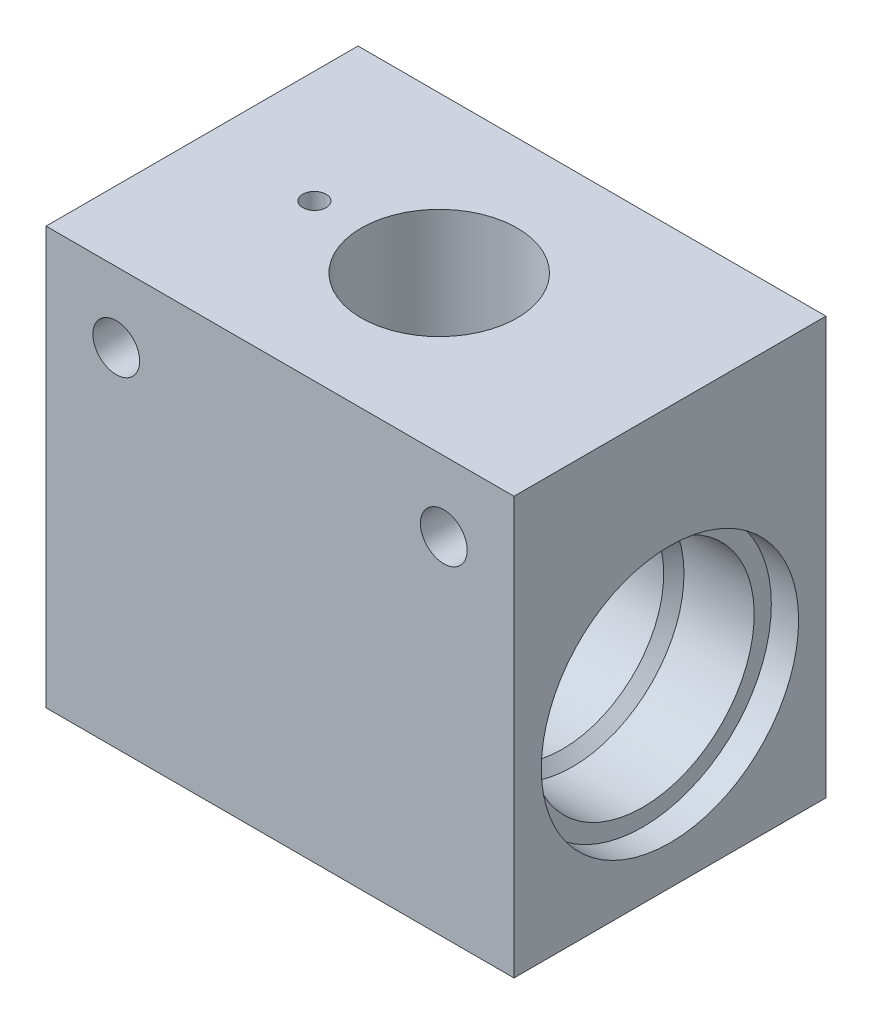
ISO-10303-21;
HEADER;
FILE_DESCRIPTION(('STEP AP214'),'2;1');
FILE_NAME('part.step','',(''),(''),'','','');
FILE_SCHEMA(('AUTOMOTIVE_DESIGN { 1 0 10303 214 1 1 1 1 }'));
ENDSEC;
DATA;
#1=APPLICATION_CONTEXT('core data for automotive mechanical design processes');
#2=APPLICATION_PROTOCOL_DEFINITION('international standard','automotive_design',2000,#1);
#3=PRODUCT_CONTEXT('',#1,'mechanical');
#4=PRODUCT('Part','Part','',(#3));
#5=PRODUCT_RELATED_PRODUCT_CATEGORY('part','',(#4));
#6=PRODUCT_DEFINITION_FORMATION('','',#4);
#7=PRODUCT_DEFINITION_CONTEXT('part definition',#1,'design');
#8=PRODUCT_DEFINITION('design','',#6,#7);
#9=PRODUCT_DEFINITION_SHAPE('','',#8);
#10=(LENGTH_UNIT() NAMED_UNIT(*) SI_UNIT(.MILLI.,.METRE.));
#11=(NAMED_UNIT(*) PLANE_ANGLE_UNIT() SI_UNIT($,.RADIAN.));
#12=(NAMED_UNIT(*) SI_UNIT($,.STERADIAN.) SOLID_ANGLE_UNIT());
#13=UNCERTAINTY_MEASURE_WITH_UNIT(LENGTH_MEASURE(1.E-05),#10,'distance_accuracy_value','');
#14=(GEOMETRIC_REPRESENTATION_CONTEXT(3) GLOBAL_UNCERTAINTY_ASSIGNED_CONTEXT((#13)) GLOBAL_UNIT_ASSIGNED_CONTEXT((#10,
#11,#12)) REPRESENTATION_CONTEXT('',''));
#15=CARTESIAN_POINT('',(0.,0.,0.));
#16=DIRECTION('',(0.,0.,1.));
#17=DIRECTION('',(1.,0.,0.));
#18=AXIS2_PLACEMENT_3D('',#15,#16,#17);
#19=CARTESIAN_POINT('',(0.,21.5,0.));
#20=DIRECTION('',(1.,0.,0.));
#21=DIRECTION('',(0.,1.,0.));
#22=AXIS2_PLACEMENT_3D('',#19,#20,#21);
#23=CYLINDRICAL_SURFACE('',#22,13.);
#24=CARTESIAN_POINT('',(46.2,21.5,0.));
#25=DIRECTION('',(-1.,0.,0.));
#26=DIRECTION('',(0.,-1.,0.));
#27=AXIS2_PLACEMENT_3D('',#24,#25,#26);
#28=CIRCLE('',#27,13.);
#29=CARTESIAN_POINT('',(46.1999999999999,8.49999999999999,0.));
#30=VERTEX_POINT('',#29);
#31=EDGE_CURVE('E239',#30,#30,#28,.T.);
#32=ORIENTED_EDGE('',*,*,#31,.F.);
#33=EDGE_LOOP('',(#32));
#34=FACE_BOUND('',#33,.T.);
#35=DIRECTION('',(1.,0.,0.));
#36=VECTOR('',#35,1.);
#37=CARTESIAN_POINT('',(0.,21.5,13.));
#38=LINE('',#37,#36);
#39=CARTESIAN_POINT('',(35.6096914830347,21.5,13.));
#40=VERTEX_POINT('',#39);
#41=CARTESIAN_POINT('',(25.2173866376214,21.5,13.));
#42=VERTEX_POINT('',#41);
#43=EDGE_CURVE('E11',#40,#42,#38,.F.);
#44=ORIENTED_EDGE('',*,*,#43,.F.);
#45=CARTESIAN_POINT('',(35.6096914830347,21.5,13.));
#46=CARTESIAN_POINT('',(35.6096803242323,21.5895443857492,13.0000020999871));
#47=CARTESIAN_POINT('',(35.6120076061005,21.6790693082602,12.9990744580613));
#48=CARTESIAN_POINT('',(35.6212345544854,21.8578198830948,12.9953816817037));
#49=CARTESIAN_POINT('',(35.6281328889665,21.9470456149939,12.992617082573));
#50=CARTESIAN_POINT('',(35.6554636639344,22.2133167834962,12.9816266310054));
#51=CARTESIAN_POINT('',(35.6825334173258,22.3896087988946,12.970703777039));
#52=CARTESIAN_POINT('',(35.7517661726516,22.7348101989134,12.9423596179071));
#53=CARTESIAN_POINT('',(35.7936110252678,22.903796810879,12.9250749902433));
#54=CARTESIAN_POINT('',(35.8901382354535,23.237430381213,12.8844715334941));
#55=CARTESIAN_POINT('',(35.9448325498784,23.4020731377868,12.861147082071));
#56=CARTESIAN_POINT('',(36.0973780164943,23.8152791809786,12.7946911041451));
#57=CARTESIAN_POINT('',(36.2024793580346,24.0605330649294,12.7477011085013));
#58=CARTESIAN_POINT('',(36.4300006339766,24.5401377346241,12.641912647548));
#59=CARTESIAN_POINT('',(36.5524309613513,24.7744818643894,12.5831070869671));
#60=CARTESIAN_POINT('',(36.8105912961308,25.2362170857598,12.4538677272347));
#61=CARTESIAN_POINT('',(36.9464630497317,25.4634912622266,12.3833030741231));
#62=CARTESIAN_POINT('',(37.2262592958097,25.9094544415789,12.2316066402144));
#63=CARTESIAN_POINT('',(37.3701868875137,26.1281400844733,12.1504707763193));
#64=CARTESIAN_POINT('',(37.6554212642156,26.5464827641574,11.9825320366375));
#65=CARTESIAN_POINT('',(37.796462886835,26.7465341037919,11.8962571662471));
#66=CARTESIAN_POINT('',(38.0813852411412,27.1404157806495,11.7146369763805));
#67=CARTESIAN_POINT('',(38.2252663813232,27.3342452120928,11.6192903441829));
#68=CARTESIAN_POINT('',(38.6591761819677,27.9072818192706,11.3195798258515));
#69=CARTESIAN_POINT('',(38.9513517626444,28.2778666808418,11.1016142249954));
#70=CARTESIAN_POINT('',(39.531798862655,28.9957768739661,10.6300010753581));
#71=CARTESIAN_POINT('',(39.8200810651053,29.3431860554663,10.3764937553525));
#72=CARTESIAN_POINT('',(40.3875059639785,30.0154240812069,9.8323131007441));
#73=CARTESIAN_POINT('',(40.6666537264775,30.340265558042,9.5416608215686));
#74=CARTESIAN_POINT('',(41.1397482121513,30.8842700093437,9.00232153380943));
#75=CARTESIAN_POINT('',(41.3370620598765,31.1090399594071,8.76221598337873));
#76=CARTESIAN_POINT('',(41.7210931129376,31.5434608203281,8.26068662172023));
#77=CARTESIAN_POINT('',(41.9078103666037,31.7531118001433,7.99926290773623));
#78=CARTESIAN_POINT('',(42.2678748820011,32.1551988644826,7.45526863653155));
#79=CARTESIAN_POINT('',(42.4412342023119,32.3476505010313,7.17271761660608));
#80=CARTESIAN_POINT('',(42.7719679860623,32.7132435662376,6.58653210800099));
#81=CARTESIAN_POINT('',(42.9293460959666,32.8863894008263,6.28290245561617));
#82=CARTESIAN_POINT('',(43.1947872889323,33.17746100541,5.71976596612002));
#83=CARTESIAN_POINT('',(43.3063434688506,33.2994276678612,5.46398807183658));
#84=CARTESIAN_POINT('',(43.5159183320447,33.5280685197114,4.94035839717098));
#85=CARTESIAN_POINT('',(43.6139400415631,33.6347461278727,4.67250933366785));
#86=CARTESIAN_POINT('',(43.7948711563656,33.8313228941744,4.12586930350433));
#87=CARTESIAN_POINT('',(43.8777863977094,33.9212285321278,3.84708261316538));
#88=CARTESIAN_POINT('',(44.0270616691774,34.0828836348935,3.2799346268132));
#89=CARTESIAN_POINT('',(44.0934215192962,34.1546329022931,2.99157322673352));
#90=CARTESIAN_POINT('',(44.2086641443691,34.2791249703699,2.40508914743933));
#91=CARTESIAN_POINT('',(44.2574189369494,34.3317286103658,2.10691153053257));
#92=CARTESIAN_POINT('',(44.3357044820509,34.41615036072,1.50511400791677));
#93=CARTESIAN_POINT('',(44.3652351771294,34.4479684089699,1.20149408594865));
#94=CARTESIAN_POINT('',(44.4043698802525,34.4901273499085,0.591600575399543));
#95=CARTESIAN_POINT('',(44.4139816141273,34.5004765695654,0.285328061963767));
#96=CARTESIAN_POINT('',(44.4130652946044,34.4994898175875,-0.327135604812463));
#97=CARTESIAN_POINT('',(44.4025390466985,34.4881557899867,-0.633326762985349));
#98=CARTESIAN_POINT('',(44.363915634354,34.4465461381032,-1.20852130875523));
#99=CARTESIAN_POINT('',(44.3379261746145,34.4185424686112,-1.47783665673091));
#100=CARTESIAN_POINT('',(44.270780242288,34.3461401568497,-2.01231079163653));
#101=CARTESIAN_POINT('',(44.2296251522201,34.301743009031,-2.27746995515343));
#102=CARTESIAN_POINT('',(44.1328680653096,34.1972586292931,-2.80199019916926));
#103=CARTESIAN_POINT('',(44.0772653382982,34.1371706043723,-3.06135098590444));
#104=CARTESIAN_POINT('',(43.9525206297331,34.0021872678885,-3.57285475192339));
#105=CARTESIAN_POINT('',(43.8833778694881,33.9272911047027,-3.82499731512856));
#106=CARTESIAN_POINT('',(43.7297921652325,33.7606557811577,-4.33008529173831));
#107=CARTESIAN_POINT('',(43.6448774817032,33.6683956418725,-4.5827147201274));
#108=CARTESIAN_POINT('',(43.4627898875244,33.4701497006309,-5.07806313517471));
#109=CARTESIAN_POINT('',(43.3656122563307,33.3641586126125,-5.32077825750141));
#110=CARTESIAN_POINT('',(43.1602526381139,33.1396206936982,-5.79553220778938));
#111=CARTESIAN_POINT('',(43.0520691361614,33.0210721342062,-6.02756955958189));
#112=CARTESIAN_POINT('',(42.825920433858,32.7725270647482,-6.48050125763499));
#113=CARTESIAN_POINT('',(42.7079531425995,32.6425281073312,-6.70139320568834));
#114=CARTESIAN_POINT('',(42.3992962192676,32.3012101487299,-7.2445770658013));
#115=CARTESIAN_POINT('',(42.2029004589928,32.082984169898,-7.55932693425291));
#116=CARTESIAN_POINT('',(41.7940002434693,31.6254845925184,-8.16197459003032));
#117=CARTESIAN_POINT('',(41.5814886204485,31.3862016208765,-8.44986030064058));
#118=CARTESIAN_POINT('',(41.1435798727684,30.8887038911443,-8.99943819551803));
#119=CARTESIAN_POINT('',(40.9181586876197,30.6304535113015,-9.26107879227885));
#120=CARTESIAN_POINT('',(40.4582703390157,30.0973727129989,-9.75796895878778));
#121=CARTESIAN_POINT('',(40.2238046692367,29.8225450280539,-9.9932228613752));
#122=CARTESIAN_POINT('',(39.7434928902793,29.2506630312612,-10.4433144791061));
#123=CARTESIAN_POINT('',(39.4975087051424,28.9532337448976,-10.6575272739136));
#124=CARTESIAN_POINT('',(39.0035044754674,28.3424992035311,-11.0595632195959));
#125=CARTESIAN_POINT('',(38.7554838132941,28.0291889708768,-11.2473780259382));
#126=CARTESIAN_POINT('',(38.2621957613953,27.385945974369,-11.5969741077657));
#127=CARTESIAN_POINT('',(38.0169295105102,27.0560066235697,-11.7587449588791));
#128=CARTESIAN_POINT('',(37.6565581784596,26.5473219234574,-11.9815985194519));
#129=CARTESIAN_POINT('',(37.5377127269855,26.3755011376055,-12.0525700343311));
#130=CARTESIAN_POINT('',(37.30374828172,26.0267819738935,-12.1878316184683));
#131=CARTESIAN_POINT('',(37.1886286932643,25.8498844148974,-12.2521227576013));
#132=CARTESIAN_POINT('',(36.9698771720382,25.500386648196,-12.3704904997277));
#133=CARTESIAN_POINT('',(36.8659619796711,25.3280892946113,-12.4249352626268));
#134=CARTESIAN_POINT('',(36.6645892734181,24.9779513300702,-12.5274548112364));
#135=CARTESIAN_POINT('',(36.5671298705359,24.800112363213,-12.5755314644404));
#136=CARTESIAN_POINT('',(36.3815800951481,24.4395959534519,-12.6646357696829));
#137=CARTESIAN_POINT('',(36.2934258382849,24.2569639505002,-12.7057128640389));
#138=CARTESIAN_POINT('',(36.1285242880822,23.8851228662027,-12.7807334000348));
#139=CARTESIAN_POINT('',(36.0517762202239,23.6959142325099,-12.8146773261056));
#140=CARTESIAN_POINT('',(35.9256684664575,23.3453389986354,-12.8693546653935));
#141=CARTESIAN_POINT('',(35.8738653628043,23.1850581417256,-12.8913653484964));
#142=CARTESIAN_POINT('',(35.7825734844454,22.8604391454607,-12.9296521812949));
#143=CARTESIAN_POINT('',(35.7430749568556,22.6961043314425,-12.9459328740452));
#144=CARTESIAN_POINT('',(35.6779651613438,22.3610861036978,-12.9725542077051));
#145=CARTESIAN_POINT('',(35.652615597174,22.1903416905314,-12.9827831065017));
#146=CARTESIAN_POINT('',(35.6183569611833,21.8464487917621,-12.9965368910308));
#147=CARTESIAN_POINT('',(35.6094974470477,21.6732946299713,-13.0000415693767));
#148=CARTESIAN_POINT('',(35.6096914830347,21.5,-13.));
#149=B_SPLINE_CURVE_WITH_KNOTS('',3,(#45,#46,#47,#48,#49,#50,#51,#52,#53,#54,#55,#56,#57,#58,
#59,#60,#61,#62,#63,#64,#65,#66,#67,#68,#69,#70,#71,#72,#73,#74,#75,#76,#77,#78,#79,#80,#81,#82,
#83,#84,#85,#86,#87,#88,#89,#90,#91,#92,#93,#94,#95,#96,#97,#98,#99,#100,#101,#102,#103,#104,
#105,#106,#107,#108,#109,#110,#111,#112,#113,#114,#115,#116,#117,#118,#119,#120,#121,#122,#123,
#124,#125,#126,#127,#128,#129,#130,#131,#132,#133,#134,#135,#136,#137,#138,#139,#140,#141,#142,
#143,#144,#145,#146,#147,#148),.UNSPECIFIED.,.F.,.F.,(4,2,2,2,2,2,2,2,2,2,2,2,2,2,2,2,2,2,2,2,2,
2,2,2,2,2,2,2,2,2,2,2,2,2,2,2,2,2,2,2,2,2,2,2,2,2,2,2,2,2,2,4),(0.,0.268561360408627,
0.537044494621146,1.0720636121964,1.59620197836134,2.12083001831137,2.93216398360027,
3.74398662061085,4.56553389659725,5.38739943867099,6.16572090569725,6.94415517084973,
8.50167979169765,10.0532236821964,11.6038919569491,12.7536059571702,13.9033147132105,
15.0519731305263,16.2003688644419,17.1131423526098,18.0257114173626,18.9379271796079,
19.850152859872,20.7688825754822,21.6876150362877,22.6059910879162,23.5242848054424,
24.3393739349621,25.1543887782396,25.9694448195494,26.7845477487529,27.6298326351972,
28.475443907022,29.3211717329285,30.1670807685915,31.4564021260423,32.7463003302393,
34.0386862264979,35.3308595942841,36.6540217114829,37.9776011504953,39.3017090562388,
39.9634910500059,40.6251668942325,41.2502724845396,41.8751943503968,42.4955004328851,
43.1157643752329,43.6248918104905,44.1336146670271,44.6514591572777,45.1708574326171),.UNSPECIFIED.);
#150=CARTESIAN_POINT('',(35.6096914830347,21.5,-13.));
#151=VERTEX_POINT('',#150);
#152=EDGE_CURVE('E42',#40,#151,#149,.T.);
#153=ORIENTED_EDGE('',*,*,#152,.T.);
#154=DIRECTION('',(1.,0.,0.));
#155=VECTOR('',#154,1.);
#156=CARTESIAN_POINT('',(0.,21.5,-13.));
#157=LINE('',#156,#155);
#158=CARTESIAN_POINT('',(25.2173866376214,21.5,-13.));
#159=VERTEX_POINT('',#158);
#160=EDGE_CURVE('E216',#159,#151,#157,.T.);
#161=ORIENTED_EDGE('',*,*,#160,.F.);
#162=CARTESIAN_POINT('',(25.2173866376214,21.5,-13.));
#163=CARTESIAN_POINT('',(25.2173977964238,21.5895443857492,-13.0000020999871));
#164=CARTESIAN_POINT('',(25.2150705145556,21.6790693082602,-12.9990744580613));
#165=CARTESIAN_POINT('',(25.2058435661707,21.8578198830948,-12.9953816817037));
#166=CARTESIAN_POINT('',(25.1989452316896,21.9470456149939,-12.992617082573));
#167=CARTESIAN_POINT('',(25.1716144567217,22.2133167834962,-12.9816266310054));
#168=CARTESIAN_POINT('',(25.1445447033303,22.3896087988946,-12.970703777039));
#169=CARTESIAN_POINT('',(25.0753119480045,22.7348101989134,-12.9423596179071));
#170=CARTESIAN_POINT('',(25.0334670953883,22.903796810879,-12.9250749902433));
#171=CARTESIAN_POINT('',(24.9369398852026,23.237430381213,-12.8844715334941));
#172=CARTESIAN_POINT('',(24.8822455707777,23.4020731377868,-12.861147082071));
#173=CARTESIAN_POINT('',(24.7297001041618,23.8152791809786,-12.7946911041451));
#174=CARTESIAN_POINT('',(24.6245987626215,24.0605330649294,-12.7477011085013));
#175=CARTESIAN_POINT('',(24.3970774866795,24.5401377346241,-12.641912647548));
#176=CARTESIAN_POINT('',(24.2746471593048,24.7744818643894,-12.5831070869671));
#177=CARTESIAN_POINT('',(24.0164868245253,25.2362170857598,-12.4538677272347));
#178=CARTESIAN_POINT('',(23.8806150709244,25.4634912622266,-12.3833030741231));
#179=CARTESIAN_POINT('',(23.6008188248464,25.9094544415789,-12.2316066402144));
#180=CARTESIAN_POINT('',(23.4568912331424,26.1281400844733,-12.1504707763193));
#181=CARTESIAN_POINT('',(23.1716568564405,26.5464827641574,-11.9825320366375));
#182=CARTESIAN_POINT('',(23.0306152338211,26.7465341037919,-11.8962571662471));
#183=CARTESIAN_POINT('',(22.7456928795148,27.1404157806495,-11.7146369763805));
#184=CARTESIAN_POINT('',(22.6018117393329,27.3342452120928,-11.6192903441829));
#185=CARTESIAN_POINT('',(22.1679019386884,27.9072818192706,-11.3195798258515));
#186=CARTESIAN_POINT('',(21.8757263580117,28.2778666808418,-11.1016142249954));
#187=CARTESIAN_POINT('',(21.2952792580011,28.9957768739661,-10.6300010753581));
#188=CARTESIAN_POINT('',(21.0069970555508,29.3431860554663,-10.3764937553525));
#189=CARTESIAN_POINT('',(20.4395721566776,30.0154240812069,-9.83231310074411));
#190=CARTESIAN_POINT('',(20.1604243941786,30.340265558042,-9.54166082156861));
#191=CARTESIAN_POINT('',(19.6873299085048,30.8842700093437,-9.00232153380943));
#192=CARTESIAN_POINT('',(19.4900160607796,31.1090399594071,-8.76221598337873));
#193=CARTESIAN_POINT('',(19.1059850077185,31.5434608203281,-8.26068662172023));
#194=CARTESIAN_POINT('',(18.9192677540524,31.7531118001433,-7.99926290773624));
#195=CARTESIAN_POINT('',(18.559203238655,32.1551988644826,-7.45526863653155));
#196=CARTESIAN_POINT('',(18.3858439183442,32.3476505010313,-7.17271761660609));
#197=CARTESIAN_POINT('',(18.0551101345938,32.7132435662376,-6.586532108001));
#198=CARTESIAN_POINT('',(17.8977320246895,32.8863894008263,-6.28290245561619));
#199=CARTESIAN_POINT('',(17.6322908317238,33.1774610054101,-5.71976596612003));
#200=CARTESIAN_POINT('',(17.5207346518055,33.2994276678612,-5.46398807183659));
#201=CARTESIAN_POINT('',(17.3111597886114,33.5280685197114,-4.94035839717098));
#202=CARTESIAN_POINT('',(17.213138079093,33.6347461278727,-4.67250933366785));
#203=CARTESIAN_POINT('',(17.0322069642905,33.8313228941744,-4.12586930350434));
#204=CARTESIAN_POINT('',(16.9492917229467,33.9212285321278,-3.84708261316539));
#205=CARTESIAN_POINT('',(16.8000164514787,34.0828836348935,-3.2799346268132));
#206=CARTESIAN_POINT('',(16.7336566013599,34.1546329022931,-2.99157322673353));
#207=CARTESIAN_POINT('',(16.618413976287,34.2791249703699,-2.40508914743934));
#208=CARTESIAN_POINT('',(16.5696591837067,34.3317286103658,-2.10691153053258));
#209=CARTESIAN_POINT('',(16.4913736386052,34.41615036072,-1.50511400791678));
#210=CARTESIAN_POINT('',(16.4618429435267,34.4479684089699,-1.20149408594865));
#211=CARTESIAN_POINT('',(16.4227082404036,34.4901273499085,-0.591600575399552));
#212=CARTESIAN_POINT('',(16.4130965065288,34.5004765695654,-0.285328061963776));
#213=CARTESIAN_POINT('',(16.4140128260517,34.4994898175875,0.327135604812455));
#214=CARTESIAN_POINT('',(16.4245390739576,34.4881557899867,0.633326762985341));
#215=CARTESIAN_POINT('',(16.4631624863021,34.4465461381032,1.20852130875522));
#216=CARTESIAN_POINT('',(16.4891519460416,34.4185424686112,1.4778366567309));
#217=CARTESIAN_POINT('',(16.5562978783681,34.3461401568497,2.01231079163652));
#218=CARTESIAN_POINT('',(16.597452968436,34.301743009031,2.27746995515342));
#219=CARTESIAN_POINT('',(16.6942100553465,34.1972586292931,2.80199019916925));
#220=CARTESIAN_POINT('',(16.7498127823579,34.1371706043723,3.06135098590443));
#221=CARTESIAN_POINT('',(16.874557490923,34.0021872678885,3.57285475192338));
#222=CARTESIAN_POINT('',(16.943700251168,33.9272911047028,3.82499731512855));
#223=CARTESIAN_POINT('',(17.0972859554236,33.7606557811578,4.33008529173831));
#224=CARTESIAN_POINT('',(17.1822006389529,33.6683956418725,4.58271472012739));
#225=CARTESIAN_POINT('',(17.3642882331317,33.470149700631,5.0780631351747));
#226=CARTESIAN_POINT('',(17.4614658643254,33.3641586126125,5.32077825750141));
#227=CARTESIAN_POINT('',(17.6668254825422,33.1396206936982,5.79553220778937));
#228=CARTESIAN_POINT('',(17.7750089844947,33.0210721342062,6.02756955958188));
#229=CARTESIAN_POINT('',(18.0011576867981,32.7725270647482,6.48050125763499));
#230=CARTESIAN_POINT('',(18.1191249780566,32.6425281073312,6.70139320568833));
#231=CARTESIAN_POINT('',(18.4277819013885,32.3012101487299,7.2445770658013));
#232=CARTESIAN_POINT('',(18.6241776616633,32.082984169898,7.5593269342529));
#233=CARTESIAN_POINT('',(19.0330778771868,31.6254845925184,8.16197459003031));
#234=CARTESIAN_POINT('',(19.2455895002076,31.3862016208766,8.44986030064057));
#235=CARTESIAN_POINT('',(19.6834982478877,30.8887038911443,8.99943819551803));
#236=CARTESIAN_POINT('',(19.9089194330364,30.6304535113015,9.26107879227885));
#237=CARTESIAN_POINT('',(20.3688077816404,30.0973727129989,9.75796895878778));
#238=CARTESIAN_POINT('',(20.6032734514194,29.8225450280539,9.99322286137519));
#239=CARTESIAN_POINT('',(21.0835852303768,29.2506630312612,10.4433144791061));
#240=CARTESIAN_POINT('',(21.3295694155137,28.9532337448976,10.6575272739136));
#241=CARTESIAN_POINT('',(21.8235736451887,28.3424992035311,11.0595632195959));
#242=CARTESIAN_POINT('',(22.071594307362,28.0291889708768,11.2473780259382));
#243=CARTESIAN_POINT('',(22.5648823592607,27.385945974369,11.5969741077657));
#244=CARTESIAN_POINT('',(22.8101486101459,27.0560066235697,11.7587449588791));
#245=CARTESIAN_POINT('',(23.1705199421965,26.5473219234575,11.9815985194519));
#246=CARTESIAN_POINT('',(23.2893653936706,26.3755011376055,12.0525700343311));
#247=CARTESIAN_POINT('',(23.523329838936,26.0267819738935,12.1878316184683));
#248=CARTESIAN_POINT('',(23.6384494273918,25.8498844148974,12.2521227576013));
#249=CARTESIAN_POINT('',(23.8572009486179,25.500386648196,12.3704904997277));
#250=CARTESIAN_POINT('',(23.961116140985,25.3280892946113,12.4249352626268));
#251=CARTESIAN_POINT('',(24.1624888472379,24.9779513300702,12.5274548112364));
#252=CARTESIAN_POINT('',(24.2599482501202,24.800112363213,12.5755314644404));
#253=CARTESIAN_POINT('',(24.445498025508,24.4395959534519,12.6646357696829));
#254=CARTESIAN_POINT('',(24.5336522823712,24.2569639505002,12.7057128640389));
#255=CARTESIAN_POINT('',(24.6985538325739,23.8851228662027,12.7807334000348));
#256=CARTESIAN_POINT('',(24.7753019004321,23.69591423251,12.8146773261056));
#257=CARTESIAN_POINT('',(24.9014096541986,23.3453389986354,12.8693546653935));
#258=CARTESIAN_POINT('',(24.9532127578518,23.1850581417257,12.8913653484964));
#259=CARTESIAN_POINT('',(25.0445046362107,22.8604391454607,12.9296521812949));
#260=CARTESIAN_POINT('',(25.0840031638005,22.6961043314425,12.9459328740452));
#261=CARTESIAN_POINT('',(25.1491129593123,22.3610861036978,12.9725542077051));
#262=CARTESIAN_POINT('',(25.1744625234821,22.1903416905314,12.9827831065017));
#263=CARTESIAN_POINT('',(25.2087211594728,21.8464487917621,12.9965368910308));
#264=CARTESIAN_POINT('',(25.2175806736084,21.6732946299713,13.0000415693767));
#265=CARTESIAN_POINT('',(25.2173866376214,21.5,13.));
#266=B_SPLINE_CURVE_WITH_KNOTS('',3,(#162,#163,#164,#165,#166,#167,#168,#169,#170,#171,#172,
#173,#174,#175,#176,#177,#178,#179,#180,#181,#182,#183,#184,#185,#186,#187,#188,#189,#190,#191,
#192,#193,#194,#195,#196,#197,#198,#199,#200,#201,#202,#203,#204,#205,#206,#207,#208,#209,#210,
#211,#212,#213,#214,#215,#216,#217,#218,#219,#220,#221,#222,#223,#224,#225,#226,#227,#228,#229,
#230,#231,#232,#233,#234,#235,#236,#237,#238,#239,#240,#241,#242,#243,#244,#245,#246,#247,#248,
#249,#250,#251,#252,#253,#254,#255,#256,#257,#258,#259,#260,#261,#262,#263,#264,#265),
.UNSPECIFIED.,.F.,.F.,(4,2,2,2,2,2,2,2,2,2,2,2,2,2,2,2,2,2,2,2,2,2,2,2,2,2,2,2,2,2,2,2,2,2,2,2,
2,2,2,2,2,2,2,2,2,2,2,2,2,2,2,4),(0.,0.268561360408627,0.537044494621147,1.0720636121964,
1.59620197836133,2.12083001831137,2.93216398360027,3.74398662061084,4.56553389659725,
5.38739943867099,6.16572090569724,6.94415517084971,8.50167979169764,10.0532236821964,
11.6038919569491,12.7536059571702,13.9033147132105,15.0519731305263,16.2003688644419,
17.1131423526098,18.0257114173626,18.9379271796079,19.850152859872,20.7688825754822,
21.6876150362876,22.6059910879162,23.5242848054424,24.3393739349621,25.1543887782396,
25.9694448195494,26.7845477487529,27.6298326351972,28.475443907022,29.3211717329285,
30.1670807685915,31.4564021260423,32.7463003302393,34.0386862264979,35.3308595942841,
36.6540217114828,37.9776011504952,39.3017090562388,39.9634910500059,40.6251668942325,
41.2502724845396,41.8751943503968,42.4955004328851,43.1157643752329,43.6248918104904,
44.1336146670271,44.6514591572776,45.1708574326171),.UNSPECIFIED.);
#267=EDGE_CURVE('E125',#159,#42,#266,.T.);
#268=ORIENTED_EDGE('',*,*,#267,.T.);
#269=EDGE_LOOP('',(#44,#153,#161,#268));
#270=FACE_BOUND('',#269,.T.);
#271=CARTESIAN_POINT('',(13.8,21.5,0.));
#272=DIRECTION('',(-1.,0.,0.));
#273=DIRECTION('',(0.,-1.,0.));
#274=AXIS2_PLACEMENT_3D('',#271,#272,#273);
#275=CIRCLE('',#274,13.);
#276=CARTESIAN_POINT('',(13.8,8.50000000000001,0.));
#277=VERTEX_POINT('',#276);
#278=EDGE_CURVE('E229',#277,#277,#275,.T.);
#279=ORIENTED_EDGE('',*,*,#278,.T.);
#280=EDGE_LOOP('',(#279));
#281=FACE_BOUND('',#280,.T.);
#282=ADVANCED_FACE('F34',(#34,#270,#281),#23,.F.);
#283=CARTESIAN_POINT('',(3.5,21.5,0.));
#284=DIRECTION('',(-1.,0.,0.));
#285=DIRECTION('',(0.,0.,1.));
#286=AXIS2_PLACEMENT_3D('',#283,#284,#285);
#287=PLANE('',#286);
#288=CARTESIAN_POINT('',(3.5,21.5,0.));
#289=DIRECTION('',(-1.,0.,0.));
#290=DIRECTION('',(0.,0.,1.));
#291=AXIS2_PLACEMENT_3D('',#288,#289,#290);
#292=CIRCLE('',#291,16.5);
#293=CARTESIAN_POINT('',(3.5,21.5,16.5));
#294=VERTEX_POINT('',#293);
#295=EDGE_CURVE('E188',#294,#294,#292,.T.);
#296=ORIENTED_EDGE('',*,*,#295,.T.);
#297=EDGE_LOOP('',(#296));
#298=FACE_BOUND('',#297,.T.);
#299=CARTESIAN_POINT('',(3.49999999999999,21.5,0.));
#300=DIRECTION('',(-1.,0.,0.));
#301=DIRECTION('',(0.,-1.,0.));
#302=AXIS2_PLACEMENT_3D('',#299,#300,#301);
#303=CIRCLE('',#302,14.3);
#304=CARTESIAN_POINT('',(3.49999999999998,7.20000000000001,0.));
#305=VERTEX_POINT('',#304);
#306=EDGE_CURVE('E234',#305,#305,#303,.T.);
#307=ORIENTED_EDGE('',*,*,#306,.F.);
#308=EDGE_LOOP('',(#307));
#309=FACE_BOUND('',#308,.T.);
#310=ADVANCED_FACE('F106',(#298,#309),#287,.T.);
#311=CARTESIAN_POINT('',(56.5,21.5,0.));
#312=DIRECTION('',(1.,0.,0.));
#313=DIRECTION('',(0.,1.,0.));
#314=AXIS2_PLACEMENT_3D('',#311,#312,#313);
#315=PLANE('',#314);
#316=CARTESIAN_POINT('',(56.5,21.5,0.));
#317=DIRECTION('',(1.,0.,0.));
#318=DIRECTION('',(0.,1.,0.));
#319=AXIS2_PLACEMENT_3D('',#316,#317,#318);
#320=CIRCLE('',#319,16.5);
#321=CARTESIAN_POINT('',(56.5,38.,0.));
#322=VERTEX_POINT('',#321);
#323=EDGE_CURVE('E182',#322,#322,#320,.T.);
#324=ORIENTED_EDGE('',*,*,#323,.T.);
#325=EDGE_LOOP('',(#324));
#326=FACE_BOUND('',#325,.T.);
#327=CARTESIAN_POINT('',(56.5,21.5,0.));
#328=DIRECTION('',(-1.,0.,0.));
#329=DIRECTION('',(0.,-1.,0.));
#330=AXIS2_PLACEMENT_3D('',#327,#328,#329);
#331=CIRCLE('',#330,14.3);
#332=CARTESIAN_POINT('',(56.5,7.19999999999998,0.));
#333=VERTEX_POINT('',#332);
#334=EDGE_CURVE('E245',#333,#333,#331,.T.);
#335=ORIENTED_EDGE('',*,*,#334,.T.);
#336=EDGE_LOOP('',(#335));
#337=FACE_BOUND('',#336,.T.);
#338=ADVANCED_FACE('F112',(#326,#337),#315,.T.);
#339=CARTESIAN_POINT('',(60.,53.5,20.));
#340=DIRECTION('',(0.,-1.,0.));
#341=DIRECTION('',(1.,0.,0.));
#342=AXIS2_PLACEMENT_3D('',#339,#340,#341);
#343=PLANE('',#342);
#344=DIRECTION('',(0.,0.,-1.));
#345=VECTOR('',#344,1.);
#346=CARTESIAN_POINT('',(60.,53.5,20.));
#347=LINE('',#346,#345);
#348=CARTESIAN_POINT('',(60.,53.5,20.));
#349=VERTEX_POINT('',#348);
#350=CARTESIAN_POINT('',(60.,53.5,-20.));
#351=VERTEX_POINT('',#350);
#352=EDGE_CURVE('E219',#349,#351,#347,.T.);
#353=ORIENTED_EDGE('',*,*,#352,.T.);
#354=DIRECTION('',(-1.,0.,0.));
#355=VECTOR('',#354,1.);
#356=CARTESIAN_POINT('',(60.,53.5,-20.));
#357=LINE('',#356,#355);
#358=CARTESIAN_POINT('',(0.,53.5,-20.));
#359=VERTEX_POINT('',#358);
#360=EDGE_CURVE('E196',#351,#359,#357,.T.);
#361=ORIENTED_EDGE('',*,*,#360,.T.);
#362=DIRECTION('',(0.,0.,-1.));
#363=VECTOR('',#362,1.);
#364=CARTESIAN_POINT('',(0.,53.5,20.));
#365=LINE('',#364,#363);
#366=CARTESIAN_POINT('',(0.,53.5,20.));
#367=VERTEX_POINT('',#366);
#368=EDGE_CURVE('E214',#367,#359,#365,.T.);
#369=ORIENTED_EDGE('',*,*,#368,.F.);
#370=DIRECTION('',(-1.,0.,0.));
#371=VECTOR('',#370,1.);
#372=CARTESIAN_POINT('',(60.,53.5,20.));
#373=LINE('',#372,#371);
#374=EDGE_CURVE('E207',#349,#367,#373,.T.);
#375=ORIENTED_EDGE('',*,*,#374,.F.);
#376=EDGE_LOOP('',(#353,#361,#369,#375));
#377=FACE_BOUND('',#376,.T.);
#378=CARTESIAN_POINT('',(30.4135390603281,53.5,0.));
#379=DIRECTION('',(0.,1.,0.));
#380=DIRECTION('',(-1.,0.,0.));
#381=AXIS2_PLACEMENT_3D('',#378,#379,#380);
#382=CIRCLE('',#381,10.);
#383=CARTESIAN_POINT('',(20.4135390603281,53.5,0.));
#384=VERTEX_POINT('',#383);
#385=EDGE_CURVE('E178',#384,#384,#382,.T.);
#386=ORIENTED_EDGE('',*,*,#385,.F.);
#387=EDGE_LOOP('',(#386));
#388=FACE_BOUND('',#387,.T.);
#389=CARTESIAN_POINT('',(14.4135390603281,53.5,0.));
#390=DIRECTION('',(0.,1.,0.));
#391=DIRECTION('',(0.,0.,1.));
#392=AXIS2_PLACEMENT_3D('',#389,#390,#391);
#393=CIRCLE('',#392,1.5);
#394=CARTESIAN_POINT('',(14.4135390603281,53.5,1.5));
#395=VERTEX_POINT('',#394);
#396=EDGE_CURVE('E248',#395,#395,#393,.T.);
#397=ORIENTED_EDGE('',*,*,#396,.F.);
#398=EDGE_LOOP('',(#397));
#399=FACE_BOUND('',#398,.T.);
#400=ADVANCED_FACE('F271',(#377,#388,#399),#343,.F.);
#401=CARTESIAN_POINT('',(0.,0.,20.));
#402=DIRECTION('',(-1.,0.,0.));
#403=DIRECTION('',(0.,0.,1.));
#404=AXIS2_PLACEMENT_3D('',#401,#402,#403);
#405=PLANE('',#404);
#406=CARTESIAN_POINT('',(0.,21.5,0.));
#407=DIRECTION('',(-1.,0.,0.));
#408=DIRECTION('',(0.,0.,1.));
#409=AXIS2_PLACEMENT_3D('',#406,#407,#408);
#410=CIRCLE('',#409,16.5);
#411=CARTESIAN_POINT('',(0.,21.5,16.5));
#412=VERTEX_POINT('',#411);
#413=EDGE_CURVE('E185',#412,#412,#410,.T.);
#414=ORIENTED_EDGE('',*,*,#413,.F.);
#415=EDGE_LOOP('',(#414));
#416=FACE_BOUND('',#415,.T.);
#417=ORIENTED_EDGE('',*,*,#368,.T.);
#418=DIRECTION('',(0.,1.,0.));
#419=VECTOR('',#418,1.);
#420=CARTESIAN_POINT('',(0.,0.,-20.));
#421=LINE('',#420,#419);
#422=CARTESIAN_POINT('',(0.,0.,-20.));
#423=VERTEX_POINT('',#422);
#424=EDGE_CURVE('E191',#423,#359,#421,.T.);
#425=ORIENTED_EDGE('',*,*,#424,.F.);
#426=DIRECTION('',(0.,0.,-1.));
#427=VECTOR('',#426,1.);
#428=CARTESIAN_POINT('',(0.,0.,20.));
#429=LINE('',#428,#427);
#430=CARTESIAN_POINT('',(0.,0.,20.));
#431=VERTEX_POINT('',#430);
#432=EDGE_CURVE('E56',#431,#423,#429,.T.);
#433=ORIENTED_EDGE('',*,*,#432,.F.);
#434=DIRECTION('',(0.,1.,0.));
#435=VECTOR('',#434,1.);
#436=CARTESIAN_POINT('',(0.,0.,20.));
#437=LINE('',#436,#435);
#438=EDGE_CURVE('E205',#431,#367,#437,.T.);
#439=ORIENTED_EDGE('',*,*,#438,.T.);
#440=EDGE_LOOP('',(#417,#425,#433,#439));
#441=FACE_BOUND('',#440,.T.);
#442=ADVANCED_FACE('F36',(#416,#441),#405,.T.);
#443=CARTESIAN_POINT('',(0.,0.,20.));
#444=DIRECTION('',(0.,1.,0.));
#445=DIRECTION('',(0.,0.,1.));
#446=AXIS2_PLACEMENT_3D('',#443,#444,#445);
#447=PLANE('',#446);
#448=ORIENTED_EDGE('',*,*,#432,.T.);
#449=DIRECTION('',(1.,0.,0.));
#450=VECTOR('',#449,1.);
#451=CARTESIAN_POINT('',(0.,0.,-20.));
#452=LINE('',#451,#450);
#453=CARTESIAN_POINT('',(60.,0.,-20.));
#454=VERTEX_POINT('',#453);
#455=EDGE_CURVE('E202',#423,#454,#452,.T.);
#456=ORIENTED_EDGE('',*,*,#455,.T.);
#457=DIRECTION('',(0.,0.,-1.));
#458=VECTOR('',#457,1.);
#459=CARTESIAN_POINT('',(60.,0.,20.));
#460=LINE('',#459,#458);
#461=CARTESIAN_POINT('',(60.,0.,20.));
#462=VERTEX_POINT('',#461);
#463=EDGE_CURVE('E217',#462,#454,#460,.T.);
#464=ORIENTED_EDGE('',*,*,#463,.F.);
#465=DIRECTION('',(1.,0.,0.));
#466=VECTOR('',#465,1.);
#467=CARTESIAN_POINT('',(0.,0.,20.));
#468=LINE('',#467,#466);
#469=EDGE_CURVE('E212',#431,#462,#468,.T.);
#470=ORIENTED_EDGE('',*,*,#469,.F.);
#471=EDGE_LOOP('',(#448,#456,#464,#470));
#472=FACE_BOUND('',#471,.T.);
#473=ADVANCED_FACE('F276',(#472),#447,.F.);
#474=CARTESIAN_POINT('',(60.,53.5,20.));
#475=DIRECTION('',(1.,0.,0.));
#476=DIRECTION('',(0.,1.,0.));
#477=AXIS2_PLACEMENT_3D('',#474,#475,#476);
#478=PLANE('',#477);
#479=CARTESIAN_POINT('',(60.,21.5,0.));
#480=DIRECTION('',(1.,0.,0.));
#481=DIRECTION('',(0.,1.,0.));
#482=AXIS2_PLACEMENT_3D('',#479,#480,#481);
#483=CIRCLE('',#482,16.5);
#484=CARTESIAN_POINT('',(60.,38.,0.));
#485=VERTEX_POINT('',#484);
#486=EDGE_CURVE('E181',#485,#485,#483,.T.);
#487=ORIENTED_EDGE('',*,*,#486,.F.);
#488=EDGE_LOOP('',(#487));
#489=FACE_BOUND('',#488,.T.);
#490=ORIENTED_EDGE('',*,*,#463,.T.);
#491=DIRECTION('',(0.,-1.,0.));
#492=VECTOR('',#491,1.);
#493=CARTESIAN_POINT('',(60.,53.5,-20.));
#494=LINE('',#493,#492);
#495=EDGE_CURVE('E199',#351,#454,#494,.T.);
#496=ORIENTED_EDGE('',*,*,#495,.F.);
#497=ORIENTED_EDGE('',*,*,#352,.F.);
#498=DIRECTION('',(0.,-1.,0.));
#499=VECTOR('',#498,1.);
#500=CARTESIAN_POINT('',(60.,53.5,20.));
#501=LINE('',#500,#499);
#502=EDGE_CURVE('E209',#349,#462,#501,.T.);
#503=ORIENTED_EDGE('',*,*,#502,.T.);
#504=EDGE_LOOP('',(#490,#496,#497,#503));
#505=FACE_BOUND('',#504,.T.);
#506=ADVANCED_FACE('F259',(#489,#505),#478,.T.);
#507=CARTESIAN_POINT('',(0.,0.,20.));
#508=DIRECTION('',(0.,0.,-1.));
#509=DIRECTION('',(-1.,0.,0.));
#510=AXIS2_PLACEMENT_3D('',#507,#508,#509);
#511=PLANE('',#510);
#512=CARTESIAN_POINT('',(51.,44.5015290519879,20.));
#513=DIRECTION('',(0.,0.,1.));
#514=DIRECTION('',(1.,0.,0.));
#515=AXIS2_PLACEMENT_3D('',#512,#513,#514);
#516=CIRCLE('',#515,3.);
#517=CARTESIAN_POINT('',(54.,44.5015290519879,20.));
#518=VERTEX_POINT('',#517);
#519=EDGE_CURVE('E166',#518,#518,#516,.T.);
#520=ORIENTED_EDGE('',*,*,#519,.F.);
#521=EDGE_LOOP('',(#520));
#522=FACE_BOUND('',#521,.T.);
#523=CARTESIAN_POINT('',(9.,44.5015290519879,20.));
#524=DIRECTION('',(0.,0.,1.));
#525=DIRECTION('',(1.,0.,0.));
#526=AXIS2_PLACEMENT_3D('',#523,#524,#525);
#527=CIRCLE('',#526,3.);
#528=CARTESIAN_POINT('',(12.,44.5015290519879,20.));
#529=VERTEX_POINT('',#528);
#530=EDGE_CURVE('E159',#529,#529,#527,.T.);
#531=ORIENTED_EDGE('',*,*,#530,.F.);
#532=EDGE_LOOP('',(#531));
#533=FACE_BOUND('',#532,.T.);
#534=ORIENTED_EDGE('',*,*,#438,.F.);
#535=ORIENTED_EDGE('',*,*,#469,.T.);
#536=ORIENTED_EDGE('',*,*,#502,.F.);
#537=ORIENTED_EDGE('',*,*,#374,.T.);
#538=EDGE_LOOP('',(#534,#535,#536,#537));
#539=FACE_BOUND('',#538,.T.);
#540=ADVANCED_FACE('F256',(#522,#533,#539),#511,.F.);
#541=CARTESIAN_POINT('',(0.,0.,-20.));
#542=DIRECTION('',(0.,0.,-1.));
#543=DIRECTION('',(-1.,0.,0.));
#544=AXIS2_PLACEMENT_3D('',#541,#542,#543);
#545=PLANE('',#544);
#546=CARTESIAN_POINT('',(51.,44.5015290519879,-20.));
#547=DIRECTION('',(0.,0.,1.));
#548=DIRECTION('',(1.,0.,0.));
#549=AXIS2_PLACEMENT_3D('',#546,#547,#548);
#550=CIRCLE('',#549,3.);
#551=CARTESIAN_POINT('',(54.,44.5015290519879,-20.));
#552=VERTEX_POINT('',#551);
#553=EDGE_CURVE('E161',#552,#552,#550,.T.);
#554=ORIENTED_EDGE('',*,*,#553,.T.);
#555=EDGE_LOOP('',(#554));
#556=FACE_BOUND('',#555,.T.);
#557=CARTESIAN_POINT('',(9.,44.5015290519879,-20.));
#558=DIRECTION('',(0.,0.,1.));
#559=DIRECTION('',(1.,0.,0.));
#560=AXIS2_PLACEMENT_3D('',#557,#558,#559);
#561=CIRCLE('',#560,3.);
#562=CARTESIAN_POINT('',(12.,44.5015290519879,-20.));
#563=VERTEX_POINT('',#562);
#564=EDGE_CURVE('E156',#563,#563,#561,.T.);
#565=ORIENTED_EDGE('',*,*,#564,.T.);
#566=EDGE_LOOP('',(#565));
#567=FACE_BOUND('',#566,.T.);
#568=ORIENTED_EDGE('',*,*,#424,.T.);
#569=ORIENTED_EDGE('',*,*,#360,.F.);
#570=ORIENTED_EDGE('',*,*,#495,.T.);
#571=ORIENTED_EDGE('',*,*,#455,.F.);
#572=EDGE_LOOP('',(#568,#569,#570,#571));
#573=FACE_BOUND('',#572,.T.);
#574=ADVANCED_FACE('F258',(#556,#567,#573),#545,.T.);
#575=CARTESIAN_POINT('',(3.5,21.5,0.));
#576=DIRECTION('',(-1.,0.,0.));
#577=DIRECTION('',(0.,0.,1.));
#578=AXIS2_PLACEMENT_3D('',#575,#576,#577);
#579=CYLINDRICAL_SURFACE('',#578,16.5);
#580=ORIENTED_EDGE('',*,*,#295,.F.);
#581=EDGE_LOOP('',(#580));
#582=FACE_BOUND('',#581,.T.);
#583=ORIENTED_EDGE('',*,*,#413,.T.);
#584=EDGE_LOOP('',(#583));
#585=FACE_BOUND('',#584,.T.);
#586=ADVANCED_FACE('F382',(#582,#585),#579,.F.);
#587=CARTESIAN_POINT('',(56.5,21.5,0.));
#588=DIRECTION('',(1.,0.,0.));
#589=DIRECTION('',(0.,1.,0.));
#590=AXIS2_PLACEMENT_3D('',#587,#588,#589);
#591=CYLINDRICAL_SURFACE('',#590,16.5);
#592=ORIENTED_EDGE('',*,*,#323,.F.);
#593=EDGE_LOOP('',(#592));
#594=FACE_BOUND('',#593,.T.);
#595=ORIENTED_EDGE('',*,*,#486,.T.);
#596=EDGE_LOOP('',(#595));
#597=FACE_BOUND('',#596,.T.);
#598=ADVANCED_FACE('F424',(#594,#597),#591,.F.);
#599=CARTESIAN_POINT('',(30.4135390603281,38.5,0.));
#600=DIRECTION('',(0.,1.,0.));
#601=DIRECTION('',(-1.,0.,0.));
#602=AXIS2_PLACEMENT_3D('',#599,#600,#601);
#603=CYLINDRICAL_SURFACE('',#602,10.);
#604=CARTESIAN_POINT('',(30.4135390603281,38.5,0.));
#605=DIRECTION('',(0.,1.,0.));
#606=DIRECTION('',(-1.,0.,0.));
#607=AXIS2_PLACEMENT_3D('',#604,#605,#606);
#608=CIRCLE('',#607,10.);
#609=CARTESIAN_POINT('',(20.4135390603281,38.5,0.));
#610=VERTEX_POINT('',#609);
#611=EDGE_CURVE('E173',#610,#610,#608,.F.);
#612=ORIENTED_EDGE('',*,*,#611,.T.);
#613=EDGE_LOOP('',(#612));
#614=FACE_BOUND('',#613,.T.);
#615=ORIENTED_EDGE('',*,*,#385,.T.);
#616=EDGE_LOOP('',(#615));
#617=FACE_BOUND('',#616,.T.);
#618=ADVANCED_FACE('F120',(#614,#617),#603,.F.);
#619=CARTESIAN_POINT('',(30.413539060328,21.5,0.));
#620=DIRECTION('',(0.,1.,0.));
#621=DIRECTION('',(-1.,0.,0.));
#622=AXIS2_PLACEMENT_3D('',#619,#620,#621);
#623=CYLINDRICAL_SURFACE('',#622,14.);
#624=CARTESIAN_POINT('',(30.4135390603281,38.5,0.));
#625=DIRECTION('',(0.,1.,0.));
#626=DIRECTION('',(-1.,0.,0.));
#627=AXIS2_PLACEMENT_3D('',#624,#625,#626);
#628=CIRCLE('',#627,14.);
#629=CARTESIAN_POINT('',(16.413539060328,38.5,0.));
#630=VERTEX_POINT('',#629);
#631=EDGE_CURVE('E163',#630,#630,#628,.T.);
#632=ORIENTED_EDGE('',*,*,#631,.T.);
#633=EDGE_LOOP('',(#632));
#634=FACE_BOUND('',#633,.T.);
#635=CARTESIAN_POINT('',(30.413539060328,21.5,0.));
#636=DIRECTION('',(0.,1.,0.));
#637=DIRECTION('',(-1.,0.,0.));
#638=AXIS2_PLACEMENT_3D('',#635,#636,#637);
#639=CIRCLE('',#638,14.);
#640=EDGE_CURVE('E170',#42,#40,#639,.T.);
#641=ORIENTED_EDGE('',*,*,#640,.F.);
#642=ORIENTED_EDGE('',*,*,#267,.F.);
#643=EDGE_CURVE('E48',#151,#159,#639,.T.);
#644=ORIENTED_EDGE('',*,*,#643,.F.);
#645=ORIENTED_EDGE('',*,*,#152,.F.);
#646=EDGE_LOOP('',(#641,#642,#644,#645));
#647=FACE_BOUND('',#646,.T.);
#648=ADVANCED_FACE('F134',(#634,#647),#623,.F.);
#649=CARTESIAN_POINT('',(30.413539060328,21.5,0.));
#650=DIRECTION('',(0.,1.,0.));
#651=DIRECTION('',(-1.,0.,0.));
#652=AXIS2_PLACEMENT_3D('',#649,#650,#651);
#653=PLANE('',#652);
#654=ORIENTED_EDGE('',*,*,#43,.T.);
#655=ORIENTED_EDGE('',*,*,#640,.T.);
#656=EDGE_LOOP('',(#654,#655));
#657=FACE_BOUND('',#656,.T.);
#658=ADVANCED_FACE('F138',(#657),#653,.T.);
#659=ORIENTED_EDGE('',*,*,#160,.T.);
#660=ORIENTED_EDGE('',*,*,#643,.T.);
#661=EDGE_LOOP('',(#659,#660));
#662=FACE_BOUND('',#661,.T.);
#663=ADVANCED_FACE('F144',(#662),#653,.T.);
#664=CARTESIAN_POINT('',(30.4135390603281,38.5,0.));
#665=DIRECTION('',(0.,1.,0.));
#666=DIRECTION('',(-1.,0.,0.));
#667=AXIS2_PLACEMENT_3D('',#664,#665,#666);
#668=PLANE('',#667);
#669=ORIENTED_EDGE('',*,*,#631,.F.);
#670=EDGE_LOOP('',(#669));
#671=FACE_BOUND('',#670,.T.);
#672=ORIENTED_EDGE('',*,*,#611,.F.);
#673=EDGE_LOOP('',(#672));
#674=FACE_BOUND('',#673,.T.);
#675=ADVANCED_FACE('F140',(#671,#674),#668,.F.);
#676=CARTESIAN_POINT('',(9.,44.5015290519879,-20.));
#677=DIRECTION('',(0.,0.,1.));
#678=DIRECTION('',(1.,0.,0.));
#679=AXIS2_PLACEMENT_3D('',#676,#677,#678);
#680=CYLINDRICAL_SURFACE('',#679,3.);
#681=ORIENTED_EDGE('',*,*,#564,.F.);
#682=EDGE_LOOP('',(#681));
#683=FACE_BOUND('',#682,.T.);
#684=ORIENTED_EDGE('',*,*,#530,.T.);
#685=EDGE_LOOP('',(#684));
#686=FACE_BOUND('',#685,.T.);
#687=ADVANCED_FACE('F101',(#683,#686),#680,.F.);
#688=CARTESIAN_POINT('',(51.,44.5015290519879,-20.));
#689=DIRECTION('',(0.,0.,1.));
#690=DIRECTION('',(1.,0.,0.));
#691=AXIS2_PLACEMENT_3D('',#688,#689,#690);
#692=CYLINDRICAL_SURFACE('',#691,3.);
#693=ORIENTED_EDGE('',*,*,#553,.F.);
#694=EDGE_LOOP('',(#693));
#695=FACE_BOUND('',#694,.T.);
#696=ORIENTED_EDGE('',*,*,#519,.T.);
#697=EDGE_LOOP('',(#696));
#698=FACE_BOUND('',#697,.T.);
#699=ADVANCED_FACE('F91',(#695,#698),#692,.F.);
#700=CARTESIAN_POINT('',(14.4135390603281,47.5987090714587,0.));
#701=DIRECTION('',(0.,1.,0.));
#702=DIRECTION('',(0.,0.,1.));
#703=AXIS2_PLACEMENT_3D('',#700,#701,#702);
#704=CONICAL_SURFACE('',#703,0.,1.02974425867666);
#705=CARTESIAN_POINT('',(14.4135390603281,48.5,0.));
#706=DIRECTION('',(0.,1.,0.));
#707=DIRECTION('',(0.,0.,1.));
#708=AXIS2_PLACEMENT_3D('',#705,#706,#707);
#709=CIRCLE('',#708,1.5);
#710=CARTESIAN_POINT('',(14.4135390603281,48.5,1.5));
#711=VERTEX_POINT('',#710);
#712=EDGE_CURVE('E251',#711,#711,#709,.T.);
#713=ORIENTED_EDGE('',*,*,#712,.T.);
#714=EDGE_LOOP('',(#713));
#715=FACE_BOUND('',#714,.T.);
#716=CARTESIAN_POINT('',(14.4135390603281,47.5987090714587,0.));
#717=VERTEX_POINT('',#716);
#718=VERTEX_LOOP('',#717);
#719=FACE_BOUND('',#718,.T.);
#720=ADVANCED_FACE('F88',(#715,#719),#704,.F.);
#721=CARTESIAN_POINT('',(14.4135390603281,53.5,0.));
#722=DIRECTION('',(0.,1.,0.));
#723=DIRECTION('',(0.,0.,1.));
#724=AXIS2_PLACEMENT_3D('',#721,#722,#723);
#725=CYLINDRICAL_SURFACE('',#724,1.5);
#726=ORIENTED_EDGE('',*,*,#396,.T.);
#727=EDGE_LOOP('',(#726));
#728=FACE_BOUND('',#727,.T.);
#729=ORIENTED_EDGE('',*,*,#712,.F.);
#730=EDGE_LOOP('',(#729));
#731=FACE_BOUND('',#730,.T.);
#732=ADVANCED_FACE('F90',(#728,#731),#725,.F.);
#733=CARTESIAN_POINT('',(41.4650548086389,21.5,0.));
#734=DIRECTION('',(-1.,0.,0.));
#735=DIRECTION('',(0.,-1.,0.));
#736=AXIS2_PLACEMENT_3D('',#733,#734,#735);
#737=CYLINDRICAL_SURFACE('',#736,14.3);
#738=CARTESIAN_POINT('',(47.5,21.5,0.));
#739=DIRECTION('',(-1.,0.,0.));
#740=DIRECTION('',(0.,-1.,0.));
#741=AXIS2_PLACEMENT_3D('',#738,#739,#740);
#742=CIRCLE('',#741,14.3);
#743=CARTESIAN_POINT('',(47.5,7.19999999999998,0.));
#744=VERTEX_POINT('',#743);
#745=EDGE_CURVE('E242',#744,#744,#742,.T.);
#746=ORIENTED_EDGE('',*,*,#745,.T.);
#747=EDGE_LOOP('',(#746));
#748=FACE_BOUND('',#747,.T.);
#749=ORIENTED_EDGE('',*,*,#334,.F.);
#750=EDGE_LOOP('',(#749));
#751=FACE_BOUND('',#750,.T.);
#752=ADVANCED_FACE('F98',(#748,#751),#737,.F.);
#753=CARTESIAN_POINT('',(47.5,21.5,0.));
#754=DIRECTION('',(1.,0.,0.));
#755=DIRECTION('',(0.,1.,0.));
#756=AXIS2_PLACEMENT_3D('',#753,#754,#755);
#757=CONICAL_SURFACE('',#756,14.3,0.785398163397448);
#758=ORIENTED_EDGE('',*,*,#31,.T.);
#759=EDGE_LOOP('',(#758));
#760=FACE_BOUND('',#759,.T.);
#761=ORIENTED_EDGE('',*,*,#745,.F.);
#762=EDGE_LOOP('',(#761));
#763=FACE_BOUND('',#762,.T.);
#764=ADVANCED_FACE('F299',(#760,#763),#757,.F.);
#765=CARTESIAN_POINT('',(41.4650548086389,21.5,0.));
#766=DIRECTION('',(-1.,0.,0.));
#767=DIRECTION('',(0.,-1.,0.));
#768=AXIS2_PLACEMENT_3D('',#765,#766,#767);
#769=CYLINDRICAL_SURFACE('',#768,14.3);
#770=ORIENTED_EDGE('',*,*,#306,.T.);
#771=EDGE_LOOP('',(#770));
#772=FACE_BOUND('',#771,.T.);
#773=CARTESIAN_POINT('',(12.5,21.5,0.));
#774=DIRECTION('',(-1.,0.,0.));
#775=DIRECTION('',(0.,-1.,0.));
#776=AXIS2_PLACEMENT_3D('',#773,#774,#775);
#777=CIRCLE('',#776,14.3);
#778=CARTESIAN_POINT('',(12.5,7.2,0.));
#779=VERTEX_POINT('',#778);
#780=EDGE_CURVE('E231',#779,#779,#777,.T.);
#781=ORIENTED_EDGE('',*,*,#780,.F.);
#782=EDGE_LOOP('',(#781));
#783=FACE_BOUND('',#782,.T.);
#784=ADVANCED_FACE('F305',(#772,#783),#769,.F.);
#785=CARTESIAN_POINT('',(13.8,21.5,0.));
#786=DIRECTION('',(-1.,0.,0.));
#787=DIRECTION('',(0.,-1.,0.));
#788=AXIS2_PLACEMENT_3D('',#785,#786,#787);
#789=CONICAL_SURFACE('',#788,13.,0.785398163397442);
#790=ORIENTED_EDGE('',*,*,#780,.T.);
#791=EDGE_LOOP('',(#790));
#792=FACE_BOUND('',#791,.T.);
#793=ORIENTED_EDGE('',*,*,#278,.F.);
#794=EDGE_LOOP('',(#793));
#795=FACE_BOUND('',#794,.T.);
#796=ADVANCED_FACE('F311',(#792,#795),#789,.F.);
#797=CLOSED_SHELL('',(#282,#310,#338,#400,#442,#473,#506,#540,#574,#586,#598,#618,#648,#658,
#663,#675,#687,#699,#720,#732,#752,#764,#784,#796));
#798=MANIFOLD_SOLID_BREP('B2',#797);
#799=ADVANCED_BREP_SHAPE_REPRESENTATION('',(#18,#798),#14);
#800=SHAPE_DEFINITION_REPRESENTATION(#9,#799);
ENDSEC;
END-ISO-10303-21;
